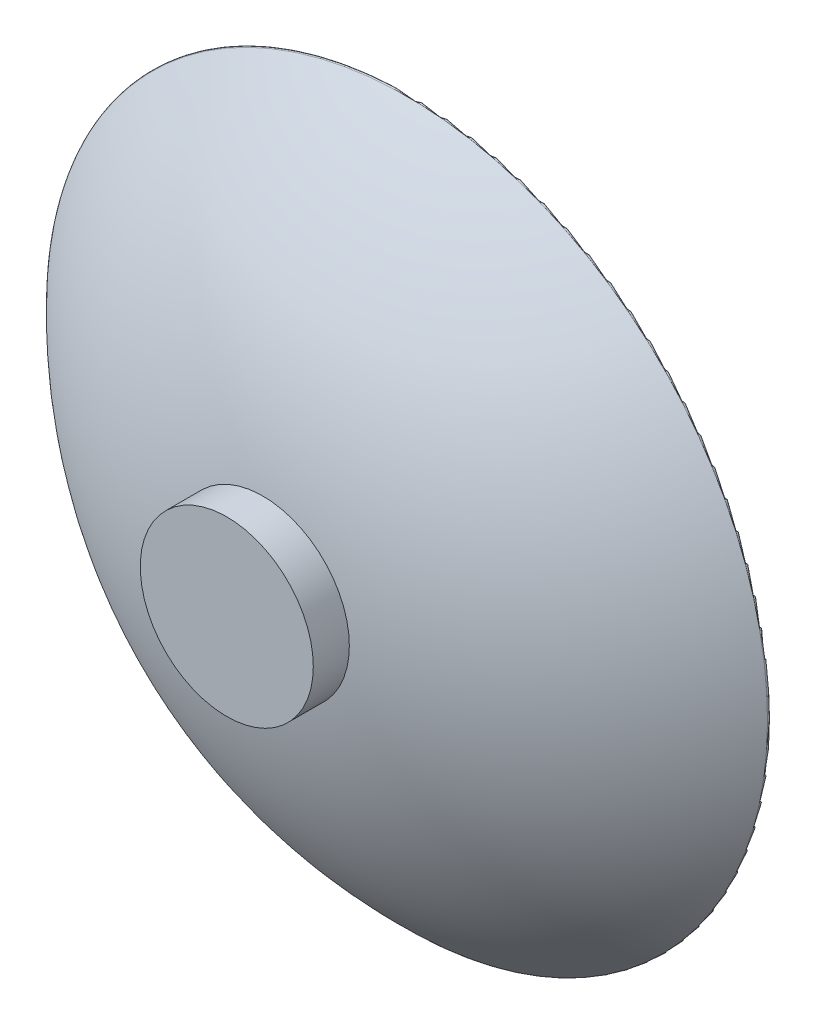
from build123d import *

# Parameters (mm, degrees)
CROQUIS1_R              = 60
SALIENTE_EXTRUIR1_DEPTH = 25


with BuildPart() as part:
    # Croquis1 → Saliente-Extruir1 (new body)
    with BuildSketch(Plane.XY):
        Circle(CROQUIS1_R)
    extrude(amount=SALIENTE_EXTRUIR1_DEPTH)


with BuildPart() as body_2:
    # Croquis2 → Revoluci_n1 (revolve)
    with BuildSketch(Plane(origin=(0, 0, 0), x_dir=(0, 0, -1), z_dir=(1, 0, 0)), mode=Mode.PRIVATE) as revoluci_n1_sk:
        with BuildLine():
            Line((1.997828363, 0.093176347), (1.997828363, 0))
            Line((1.997828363, 0), (0, 0))
            ThreePointArc((0, 0), (22.892184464, 135.843126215), (100, 250))
            ThreePointArc((100, 250), (101.41386447, 249.968579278), (101.382443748, 248.554714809))
            ThreePointArc((101.382443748, 248.554714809), (101.334862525, 245.728978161), (98.509052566, 245.771985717))
            ThreePointArc((98.509052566, 245.771985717), (98.19051645, 245.459222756), (97.872412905, 245.146019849))
            ThreePointArc((97.872412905, 245.146019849), (97.86764016, 242.319886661), (95.041502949, 242.320085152))
            ThreePointArc((95.041502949, 242.320085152), (94.727740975, 242.00253303), (94.414418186, 241.684547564))
            ThreePointArc((94.414418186, 241.684547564), (94.452455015, 238.858666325), (91.626639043, 238.816055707))
            ThreePointArc((91.626639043, 238.816055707), (91.317723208, 238.493787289), (91.009253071, 238.171092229))
            ThreePointArc((91.009253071, 238.171092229), (91.090090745, 235.346111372), (88.265244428, 235.260701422))
            ThreePointArc((88.265244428, 235.260701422), (87.961245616, 234.933790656), (87.657698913, 234.606460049))
            ThreePointArc((87.657698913, 234.606460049), (87.781318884, 231.783027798), (84.958090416, 231.654838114))
            ThreePointArc((84.958090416, 231.654838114), (84.659078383, 231.323360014), (84.360524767, 230.99146897))
            ThreePointArc((84.360524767, 230.99146897), (84.526898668, 228.170233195), (81.705935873, 227.999293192))
            ThreePointArc((81.705935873, 227.999293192), (81.41197923, 227.66332382), (81.118487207, 227.326948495))
            ThreePointArc((81.118487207, 227.326948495), (81.327576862, 224.508556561), (78.509527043, 224.294905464))
            ThreePointArc((78.509527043, 224.294905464), (78.220693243, 223.954521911), (77.932330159, 223.613739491))
            ThreePointArc((77.932330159, 223.613739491), (78.184087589, 220.798838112), (75.36959738, 220.542524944))
            ThreePointArc((75.36959738, 220.542524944), (75.085952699, 220.197805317), (74.802784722, 219.852693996))
            ThreePointArc((74.802784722, 219.852693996), (75.097152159, 217.041929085), (72.286867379, 216.743012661))
            ThreePointArc((72.286867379, 216.743012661), (72.008476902, 216.394036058), (71.730569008, 216.044675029))
            ThreePointArc((71.730569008, 216.044675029), (72.067478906, 213.238691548), (69.262044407, 212.897240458))
            ThreePointArc((69.262044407, 212.897240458), (68.988972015, 212.544086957), (68.716387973, 212.190556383))
            ThreePointArc((68.716387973, 212.190556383), (69.095763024, 209.389998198), (66.295822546, 209.006090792))
            ThreePointArc((66.295822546, 209.006090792), (66.028130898, 208.648841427), (65.760933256, 208.291222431))
            ThreePointArc((65.760933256, 208.291222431), (66.182686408, 205.496732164), (63.388882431, 205.070456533))
            ThreePointArc((63.388882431, 205.070456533), (63.126632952, 204.709193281), (62.864883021, 204.347567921))
            ThreePointArc((62.864883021, 204.347567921), (63.328917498, 201.5597868), (60.541891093, 201.09124076))
            ThreePointArc((60.541891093, 201.09124076), (60.28514396, 200.726046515), (60.028901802, 200.360497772))
            ThreePointArc((60.028901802, 200.360497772), (60.535111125, 197.580065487), (57.755501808, 197.069356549))
            ThreePointArc((57.755501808, 197.069356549), (57.504315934, 196.700315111), (57.253640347, 196.330926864))
            ThreePointArc((57.253640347, 196.330926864), (57.801908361, 193.558481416), (55.030353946, 193.00572677))
            ThreePointArc((55.030353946, 193.00572677), (54.784786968, 192.632922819), (54.539735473, 192.259779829))
            ThreePointArc((54.539735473, 192.259779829), (55.129936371, 189.495957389), (52.367072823, 188.901283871))
            ThreePointArc((52.367072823, 188.901283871), (52.12718109, 188.524802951), (51.887809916, 188.147990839))
            ThreePointArc((51.887809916, 188.147990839), (52.51980827, 185.3934256), (49.766269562, 184.756969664))
            ThreePointArc((49.766269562, 184.756969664), (49.53210812, 184.376898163), (49.298472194, 183.996503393))
            ThreePointArc((49.298472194, 183.996503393), (49.972122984, 181.251827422), (47.228540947, 180.57373511))
            ThreePointArc((47.228540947, 180.57373511), (47.000163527, 180.190160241), (46.77231646, 179.8062701))
            ThreePointArc((46.77231646, 179.8062701), (47.487465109, 177.072113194), (44.754469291, 176.352540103))
            Line((44.754469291, 176.352540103), (44.309922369, 175.578252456))
            ThreePointArc((44.309922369, 175.578252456), (45.066404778, 172.855242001), (42.344622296, 172.094353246))
            ThreePointArc((42.344622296, 172.094353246), (42.127968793, 171.704036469), (41.911854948, 171.313420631))
            ThreePointArc((41.911854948, 171.313420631), (42.709497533, 168.602181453), (39.999552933, 167.800151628))
            ThreePointArc((39.999552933, 167.800151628), (39.788836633, 167.406597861), (39.578664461, 167.012753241))
            ThreePointArc((39.578664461, 167.012753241), (40.417284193, 164.313907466), (37.719799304, 163.470920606))
            ThreePointArc((37.719799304, 163.470920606), (37.51506856, 163.074220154), (37.310886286, 162.677237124))
            ThreePointArc((37.310886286, 162.677237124), (38.190290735, 159.991404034), (35.505884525, 159.107653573))
            ThreePointArc((35.505884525, 159.107653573), (35.307186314, 158.707897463), (35.109040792, 158.307867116))
            ThreePointArc((35.109040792, 158.307867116), (36.029028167, 155.635663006), (33.358316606, 154.711351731))
            ThreePointArc((33.358316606, 154.711351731), (33.165696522, 154.308631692), (32.973633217, 153.90564582))
            ThreePointArc((32.973633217, 153.90564582), (33.933992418, 151.247683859), (31.277588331, 150.283023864))
            ThreePointArc((31.277588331, 150.283023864), (31.091090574, 149.877432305), (30.905153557, 149.471583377))
            ThreePointArc((30.905153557, 149.471583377), (31.905664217, 146.828473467), (29.264177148, 145.823686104))
            ThreePointArc((29.264177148, 145.823686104), (29.083844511, 145.415316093), (28.904076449, 145.006697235))
            ThreePointArc((28.904076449, 145.006697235), (29.944508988, 142.379045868), (27.318545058, 141.334361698))
            ThreePointArc((27.318545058, 141.334361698), (27.14441892, 140.92330694), (26.970861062, 140.512011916))
            ThreePointArc((26.970861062, 140.512011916), (28.050976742, 137.900422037), (25.441138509, 136.816080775))
            ThreePointArc((25.441138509, 136.816080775), (25.273258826, 136.402435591), (25.105950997, 135.988558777))
            ThreePointArc((25.105950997, 135.988558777), (26.225501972, 133.393629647), (23.632388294, 132.269880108))
            ThreePointArc((23.632388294, 132.269880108), (23.470793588, 131.853739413), (23.309774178, 131.437375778))
            ThreePointArc((23.309774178, 131.437375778), (24.468503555, 128.859702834), (21.892709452, 127.696802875))
            ThreePointArc((21.892709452, 127.696802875), (21.737436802, 127.278262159), (21.58274276, 126.859507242))
            ThreePointArc((21.58274276, 126.859507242), (22.780384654, 124.299681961), (20.222501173, 123.097898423))
            ThreePointArc((20.222501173, 123.097898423), (20.073586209, 122.677053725), (19.925253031, 122.256003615))
            ThreePointArc((19.925253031, 122.256003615), (21.161532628, 119.714613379), (18.622146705, 118.474222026))
            ThreePointArc((18.622146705, 118.474222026), (18.479623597, 118.051169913), (18.33768532, 117.627921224))
            ThreePointArc((18.33768532, 117.627921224), (19.612318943, 115.105549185), (17.09201327, 113.826834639))
            ThreePointArc((17.09201327, 113.826834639), (16.955914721, 113.401672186), (16.820403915, 112.976322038))
            ThreePointArc((16.820403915, 112.976322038), (18.133099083, 110.473546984), (15.632451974, 109.156802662))
            ThreePointArc((15.632451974, 109.156802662), (15.502809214, 108.729627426), (15.373756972, 108.302273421))
            ThreePointArc((15.373756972, 108.302273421), (16.724212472, 105.819669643), (14.24379773, 104.465197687))
            ThreePointArc((14.24379773, 104.465197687), (14.120640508, 104.03610769), (13.998076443, 103.606847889))
            ThreePointArc((13.998076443, 103.606847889), (15.385982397, 101.14498505), (12.926369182, 99.753096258))
            ThreePointArc((12.926369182, 99.753096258), (12.809725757, 99.32218996), (12.693677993, 98.891122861))
            ThreePointArc((12.693677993, 98.891122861), (14.11871593, 96.450565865), (11.68046863, 95.021579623))
            Line((11.68046863, 95.021579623), (11.460860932, 94.156180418))
            ThreePointArc((11.460860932, 94.156180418), (12.92270386, 91.737489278), (10.506381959, 90.271733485))
            ThreePointArc((10.506381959, 90.271733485), (10.402844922, 89.837491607), (10.299908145, 89.403107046))
            ThreePointArc((10.299908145, 89.403107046), (11.798220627, 87.00683676), (9.404378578, 85.504647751))
            ThreePointArc((9.404378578, 85.504647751), (9.307431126, 85.06888736), (9.211086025, 84.632993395))
            ThreePointArc((9.211086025, 84.632993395), (10.745524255, 82.259693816), (8.374711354, 80.721416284))
            ThreePointArc((8.374711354, 80.721416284), (8.284375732, 80.284237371), (8.194644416, 79.846934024))
            ThreePointArc((8.194644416, 79.846934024), (9.7648563, 77.497149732), (7.417616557, 75.923136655))
            ThreePointArc((7.417616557, 75.923136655), (7.333913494, 75.484639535), (7.250816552, 75.04602715))
            ThreePointArc((7.250816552, 75.04602715), (8.856441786, 72.720297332), (6.533313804, 71.110909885))
            ThreePointArc((6.533313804, 71.110909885), (6.456262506, 70.671195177), (6.379819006, 70.231374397))
            ThreePointArc((6.379819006, 70.231374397), (8.02048916, 67.930232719), (5.722006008, 66.285840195))
            ThreePointArc((5.722006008, 66.285840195), (5.651624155, 65.845008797), (5.581851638, 65.404080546))
            ThreePointArc((5.581851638, 65.404080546), (7.257190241, 63.128055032), (4.983879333, 61.449034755))
            ThreePointArc((4.983879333, 61.449034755), (4.920183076, 61.007187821), (4.857097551, 60.565253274))
            ThreePointArc((4.857097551, 60.565253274), (6.566720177, 58.314866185), (4.319103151, 56.601603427))
            ThreePointArc((4.319103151, 56.601603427), (4.262107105, 56.158842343), (4.205723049, 55.716002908))
            ThreePointArc((4.205723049, 55.716002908), (5.949237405, 53.491770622), (3.727830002, 51.744658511))
            ThreePointArc((3.727830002, 51.744658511), (3.677547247, 51.301084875), (3.627877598, 50.857442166))
            ThreePointArc((3.627877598, 50.857442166), (5.404883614, 48.659875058), (3.210195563, 46.879314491))
            ThreePointArc((3.210195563, 46.879314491), (3.166637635, 46.435030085), (3.123693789, 45.990685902))
            ThreePointArc((3.123693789, 45.990685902), (4.933783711, 43.82028823), (2.766318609, 42.006687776))
            ThreePointArc((2.766318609, 42.006687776), (2.729495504, 41.561794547), (2.693287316, 41.116850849))
            ThreePointArc((2.693287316, 41.116850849), (4.536045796, 38.974120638), (2.396300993, 37.127896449))
            ThreePointArc((2.396300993, 37.127896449), (2.366221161, 36.682496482), (2.336756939, 36.237055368))
            ThreePointArc((2.336756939, 36.237055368), (4.211761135, 34.122484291), (2.100227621, 32.244060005))
            ThreePointArc((2.100227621, 32.244060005), (2.076897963, 31.798255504), (2.054184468, 31.352419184))
            ThreePointArc((2.054184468, 31.352419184), (3.961004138, 29.266492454), (1.87816643, 27.356299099))
            ThreePointArc((1.87816643, 27.356299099), (1.861592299, 26.910192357), (1.845634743, 26.464063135))
            ThreePointArc((1.845634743, 26.464063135), (3.783832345, 24.407259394), (1.730168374, 22.465735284))
            ThreePointArc((1.730168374, 22.465735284), (1.720353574, 22.019428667), (1.711155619, 21.573108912))
            ThreePointArc((1.711155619, 21.573108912), (3.680286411, 19.545900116), (1.656267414, 17.573490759))
            ThreePointArc((1.656267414, 17.573490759), (1.653214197, 17.127086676), (1.650777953, 16.680678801))
            ThreePointArc((1.650777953, 16.680678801), (3.650390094, 14.683530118), (1.656480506, 12.680688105))
            ThreePointArc((1.656480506, 12.680688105), (1.765808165, 6.385268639), (1.997828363, 0.093176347))
        make_face()
    revolve(revoluci_n1_sk.sketch.rotate(Axis((0, 0, 0), (0, 0, -1)), 90), axis=Axis((0, 0, 0), (0, 0, -1)))


with BuildPart() as body_3:
    # Croquis3 → Revoluci_n-L_mina8 (revolve)
    with BuildSketch(Plane(origin=(0, 0, 0), x_dir=(0, 0, -1), z_dir=(1, 0, 0))):
        with BuildLine():
            ThreePointArc((1.376783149, 0), (51.376783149, 50), (101.376783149, 0))
            Line((101.376783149, 0), (101.276783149, 0))
            ThreePointArc((101.276783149, 0), (51.376783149, 49.9), (1.476783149, 0))
            Line((1.476783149, 0), (1.376783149, 0))
        make_face()
    revolve(axis=Axis((0, 0, -1.376783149), (0, 0, -1)))


solid = Compound([part.part, body_2.part, body_3.part])
